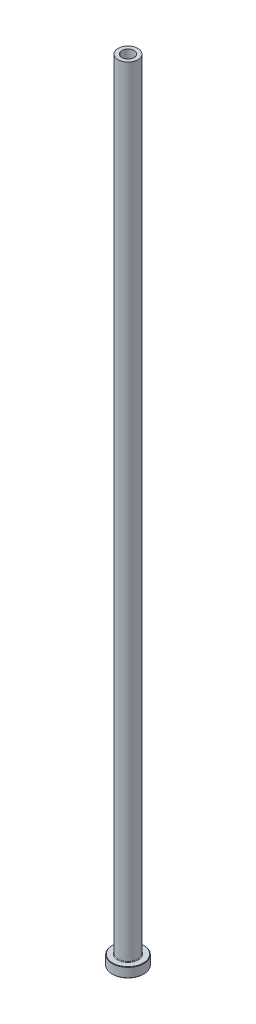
ISO-10303-21;
HEADER;
FILE_DESCRIPTION(('STEP AP214'),'2;1');
FILE_NAME('part.step','',(''),(''),'','','');
FILE_SCHEMA(('AUTOMOTIVE_DESIGN { 1 0 10303 214 1 1 1 1 }'));
ENDSEC;
DATA;
#1=APPLICATION_CONTEXT('core data for automotive mechanical design processes');
#2=APPLICATION_PROTOCOL_DEFINITION('international standard','automotive_design',2000,#1);
#3=PRODUCT_CONTEXT('',#1,'mechanical');
#4=PRODUCT('Part','Part','',(#3));
#5=PRODUCT_RELATED_PRODUCT_CATEGORY('part','',(#4));
#6=PRODUCT_DEFINITION_FORMATION('','',#4);
#7=PRODUCT_DEFINITION_CONTEXT('part definition',#1,'design');
#8=PRODUCT_DEFINITION('design','',#6,#7);
#9=PRODUCT_DEFINITION_SHAPE('','',#8);
#10=(LENGTH_UNIT() NAMED_UNIT(*) SI_UNIT(.MILLI.,.METRE.));
#11=(NAMED_UNIT(*) PLANE_ANGLE_UNIT() SI_UNIT($,.RADIAN.));
#12=(NAMED_UNIT(*) SI_UNIT($,.STERADIAN.) SOLID_ANGLE_UNIT());
#13=UNCERTAINTY_MEASURE_WITH_UNIT(LENGTH_MEASURE(1.E-05),#10,'distance_accuracy_value','');
#14=(GEOMETRIC_REPRESENTATION_CONTEXT(3) GLOBAL_UNCERTAINTY_ASSIGNED_CONTEXT((#13)) GLOBAL_UNIT_ASSIGNED_CONTEXT((#10,
#11,#12)) REPRESENTATION_CONTEXT('',''));
#15=CARTESIAN_POINT('',(0.,0.,0.));
#16=DIRECTION('',(0.,0.,1.));
#17=DIRECTION('',(1.,0.,0.));
#18=AXIS2_PLACEMENT_3D('',#15,#16,#17);
#19=CARTESIAN_POINT('',(0.,92.1876809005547,0.));
#20=DIRECTION('',(0.,1.,0.));
#21=DIRECTION('',(0.,0.,1.));
#22=AXIS2_PLACEMENT_3D('',#19,#20,#21);
#23=CYLINDRICAL_SURFACE('',#22,3.10000000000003);
#24=CARTESIAN_POINT('',(0.,400.,0.));
#25=DIRECTION('',(0.,1.,0.));
#26=DIRECTION('',(0.,0.,1.));
#27=AXIS2_PLACEMENT_3D('',#24,#25,#26);
#28=CIRCLE('',#27,3.10000000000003);
#29=CARTESIAN_POINT('',(0.,400.,3.10000000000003));
#30=VERTEX_POINT('',#29);
#31=EDGE_CURVE('E62',#30,#30,#28,.T.);
#32=ORIENTED_EDGE('',*,*,#31,.T.);
#33=EDGE_LOOP('',(#32));
#34=FACE_BOUND('',#33,.T.);
#35=CARTESIAN_POINT('',(0.,355.,0.));
#36=DIRECTION('',(0.,1.,0.));
#37=DIRECTION('',(0.,0.,1.));
#38=AXIS2_PLACEMENT_3D('',#35,#36,#37);
#39=CIRCLE('',#38,3.10000000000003);
#40=CARTESIAN_POINT('',(0.,355.,3.10000000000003));
#41=VERTEX_POINT('',#40);
#42=EDGE_CURVE('E71',#41,#41,#39,.T.);
#43=ORIENTED_EDGE('',*,*,#42,.F.);
#44=EDGE_LOOP('',(#43));
#45=FACE_BOUND('',#44,.T.);
#46=ADVANCED_FACE('F30',(#34,#45),#23,.F.);
#47=CARTESIAN_POINT('',(-3.10000000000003,400.,0.));
#48=DIRECTION('',(0.,1.,0.));
#49=DIRECTION('',(0.,0.,1.));
#50=AXIS2_PLACEMENT_3D('',#47,#48,#49);
#51=PLANE('',#50);
#52=CARTESIAN_POINT('',(0.,400.,0.));
#53=DIRECTION('',(0.,1.,0.));
#54=DIRECTION('',(0.,0.,1.));
#55=AXIS2_PLACEMENT_3D('',#52,#53,#54);
#56=CIRCLE('',#55,5.00000000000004);
#57=CARTESIAN_POINT('',(0.,400.,5.00000000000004));
#58=VERTEX_POINT('',#57);
#59=EDGE_CURVE('E65',#58,#58,#56,.T.);
#60=ORIENTED_EDGE('',*,*,#59,.T.);
#61=EDGE_LOOP('',(#60));
#62=FACE_BOUND('',#61,.T.);
#63=ORIENTED_EDGE('',*,*,#31,.F.);
#64=EDGE_LOOP('',(#63));
#65=FACE_BOUND('',#64,.T.);
#66=ADVANCED_FACE('F79',(#62,#65),#51,.T.);
#67=CARTESIAN_POINT('',(0.,92.1876809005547,0.));
#68=DIRECTION('',(0.,1.,0.));
#69=DIRECTION('',(0.,0.,1.));
#70=AXIS2_PLACEMENT_3D('',#67,#68,#69);
#71=CYLINDRICAL_SURFACE('',#70,5.00000000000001);
#72=CARTESIAN_POINT('',(0.,5.3,0.));
#73=DIRECTION('',(0.,1.,0.));
#74=DIRECTION('',(0.,0.,1.));
#75=AXIS2_PLACEMENT_3D('',#72,#73,#74);
#76=CIRCLE('',#75,5.00000000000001);
#77=CARTESIAN_POINT('',(0.,5.3,5.00000000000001));
#78=VERTEX_POINT('',#77);
#79=EDGE_CURVE('E59',#78,#78,#76,.T.);
#80=ORIENTED_EDGE('',*,*,#79,.T.);
#81=EDGE_LOOP('',(#80));
#82=FACE_BOUND('',#81,.T.);
#83=ORIENTED_EDGE('',*,*,#59,.F.);
#84=EDGE_LOOP('',(#83));
#85=FACE_BOUND('',#84,.T.);
#86=ADVANCED_FACE('F85',(#82,#85),#71,.T.);
#87=CARTESIAN_POINT('',(-4.99999999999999,5.,0.));
#88=DIRECTION('',(0.,1.,0.));
#89=DIRECTION('',(0.,0.,1.));
#90=AXIS2_PLACEMENT_3D('',#87,#88,#89);
#91=PLANE('',#90);
#92=CARTESIAN_POINT('',(0.,5.,0.));
#93=DIRECTION('',(0.,1.,0.));
#94=DIRECTION('',(0.,0.,1.));
#95=AXIS2_PLACEMENT_3D('',#92,#93,#94);
#96=CIRCLE('',#95,7.80000000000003);
#97=CARTESIAN_POINT('',(0.,5.,7.80000000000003));
#98=VERTEX_POINT('',#97);
#99=EDGE_CURVE('E53',#98,#98,#96,.T.);
#100=ORIENTED_EDGE('',*,*,#99,.T.);
#101=EDGE_LOOP('',(#100));
#102=FACE_BOUND('',#101,.T.);
#103=CARTESIAN_POINT('',(0.,5.,0.));
#104=DIRECTION('',(0.,1.,0.));
#105=DIRECTION('',(0.,0.,1.));
#106=AXIS2_PLACEMENT_3D('',#103,#104,#105);
#107=CIRCLE('',#106,5.30000000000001);
#108=CARTESIAN_POINT('',(0.,5.,5.30000000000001));
#109=VERTEX_POINT('',#108);
#110=EDGE_CURVE('E56',#109,#109,#107,.F.);
#111=ORIENTED_EDGE('',*,*,#110,.T.);
#112=EDGE_LOOP('',(#111));
#113=FACE_BOUND('',#112,.T.);
#114=ADVANCED_FACE('F111',(#102,#113),#91,.T.);
#115=CARTESIAN_POINT('',(0.,92.1876809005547,0.));
#116=DIRECTION('',(0.,1.,0.));
#117=DIRECTION('',(0.,0.,1.));
#118=AXIS2_PLACEMENT_3D('',#115,#116,#117);
#119=CYLINDRICAL_SURFACE('',#118,7.99999999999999);
#120=CARTESIAN_POINT('',(0.,4.80000000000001,0.));
#121=DIRECTION('',(0.,1.,0.));
#122=DIRECTION('',(0.,0.,1.));
#123=AXIS2_PLACEMENT_3D('',#120,#121,#122);
#124=CIRCLE('',#123,7.99999999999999);
#125=CARTESIAN_POINT('',(0.,4.80000000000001,7.99999999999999));
#126=VERTEX_POINT('',#125);
#127=EDGE_CURVE('E45',#126,#126,#124,.F.);
#128=ORIENTED_EDGE('',*,*,#127,.T.);
#129=EDGE_LOOP('',(#128));
#130=FACE_BOUND('',#129,.T.);
#131=CARTESIAN_POINT('',(0.,0.200000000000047,0.));
#132=DIRECTION('',(0.,-1.,0.));
#133=DIRECTION('',(0.,0.,-1.));
#134=AXIS2_PLACEMENT_3D('',#131,#132,#133);
#135=CIRCLE('',#134,7.99999999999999);
#136=CARTESIAN_POINT('',(0.,0.200000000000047,-7.99999999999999));
#137=VERTEX_POINT('',#136);
#138=EDGE_CURVE('E50',#137,#137,#135,.F.);
#139=ORIENTED_EDGE('',*,*,#138,.T.);
#140=EDGE_LOOP('',(#139));
#141=FACE_BOUND('',#140,.T.);
#142=ADVANCED_FACE('F108',(#130,#141),#119,.T.);
#143=CARTESIAN_POINT('',(-7.99999999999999,0.,0.));
#144=DIRECTION('',(0.,-1.,0.));
#145=DIRECTION('',(0.,0.,-1.));
#146=AXIS2_PLACEMENT_3D('',#143,#144,#145);
#147=PLANE('',#146);
#148=CARTESIAN_POINT('',(0.,0.,0.));
#149=DIRECTION('',(0.,-1.,0.));
#150=DIRECTION('',(0.,0.,-1.));
#151=AXIS2_PLACEMENT_3D('',#148,#149,#150);
#152=CIRCLE('',#151,3.84999999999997);
#153=CARTESIAN_POINT('',(0.,0.,-3.84999999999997));
#154=VERTEX_POINT('',#153);
#155=EDGE_CURVE('E37',#154,#154,#152,.F.);
#156=ORIENTED_EDGE('',*,*,#155,.T.);
#157=EDGE_LOOP('',(#156));
#158=FACE_BOUND('',#157,.T.);
#159=CARTESIAN_POINT('',(0.,0.,0.));
#160=DIRECTION('',(0.,-1.,0.));
#161=DIRECTION('',(0.,0.,-1.));
#162=AXIS2_PLACEMENT_3D('',#159,#160,#161);
#163=CIRCLE('',#162,7.79999999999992);
#164=CARTESIAN_POINT('',(0.,0.,-7.79999999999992));
#165=VERTEX_POINT('',#164);
#166=EDGE_CURVE('E41',#165,#165,#163,.T.);
#167=ORIENTED_EDGE('',*,*,#166,.T.);
#168=EDGE_LOOP('',(#167));
#169=FACE_BOUND('',#168,.T.);
#170=ADVANCED_FACE('F110',(#158,#169),#147,.T.);
#171=CARTESIAN_POINT('',(0.,92.1876809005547,0.));
#172=DIRECTION('',(0.,1.,0.));
#173=DIRECTION('',(0.,0.,1.));
#174=AXIS2_PLACEMENT_3D('',#171,#172,#173);
#175=CYLINDRICAL_SURFACE('',#174,3.35000000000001);
#176=CARTESIAN_POINT('',(0.,0.499999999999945,0.));
#177=DIRECTION('',(0.,-1.,0.));
#178=DIRECTION('',(0.,0.,-1.));
#179=AXIS2_PLACEMENT_3D('',#176,#177,#178);
#180=CIRCLE('',#179,3.35000000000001);
#181=CARTESIAN_POINT('',(0.,0.499999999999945,-3.35000000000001));
#182=VERTEX_POINT('',#181);
#183=EDGE_CURVE('E10',#182,#182,#180,.T.);
#184=ORIENTED_EDGE('',*,*,#183,.T.);
#185=EDGE_LOOP('',(#184));
#186=FACE_BOUND('',#185,.T.);
#187=CARTESIAN_POINT('',(0.,343.,0.));
#188=DIRECTION('',(0.,1.,0.));
#189=DIRECTION('',(0.,0.,1.));
#190=AXIS2_PLACEMENT_3D('',#187,#188,#189);
#191=CIRCLE('',#190,3.35000000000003);
#192=CARTESIAN_POINT('',(0.,343.,3.35000000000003));
#193=VERTEX_POINT('',#192);
#194=EDGE_CURVE('E68',#193,#193,#191,.T.);
#195=ORIENTED_EDGE('',*,*,#194,.T.);
#196=EDGE_LOOP('',(#195));
#197=FACE_BOUND('',#196,.T.);
#198=ADVANCED_FACE('F118',(#186,#197),#175,.F.);
#199=CARTESIAN_POINT('',(0.,343.,0.));
#200=DIRECTION('',(0.,-1.,0.));
#201=DIRECTION('',(0.,0.,-1.));
#202=AXIS2_PLACEMENT_3D('',#199,#200,#201);
#203=CONICAL_SURFACE('',#202,3.35000000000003,0.0208303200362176);
#204=ORIENTED_EDGE('',*,*,#42,.T.);
#205=EDGE_LOOP('',(#204));
#206=FACE_BOUND('',#205,.T.);
#207=ORIENTED_EDGE('',*,*,#194,.F.);
#208=EDGE_LOOP('',(#207));
#209=FACE_BOUND('',#208,.T.);
#210=ADVANCED_FACE('F75',(#206,#209),#203,.F.);
#211=CARTESIAN_POINT('',(0.,5.3,0.));
#212=DIRECTION('',(0.,1.,0.));
#213=DIRECTION('',(0.,0.,1.));
#214=AXIS2_PLACEMENT_3D('',#211,#212,#213);
#215=TOROIDAL_SURFACE('',#214,5.30000000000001,0.3);
#216=ORIENTED_EDGE('',*,*,#110,.F.);
#217=EDGE_LOOP('',(#216));
#218=FACE_BOUND('',#217,.T.);
#219=ORIENTED_EDGE('',*,*,#79,.F.);
#220=EDGE_LOOP('',(#219));
#221=FACE_BOUND('',#220,.T.);
#222=ADVANCED_FACE('F90',(#218,#221),#215,.F.);
#223=CARTESIAN_POINT('',(0.,5.,0.));
#224=DIRECTION('',(0.,-1.,0.));
#225=DIRECTION('',(0.,0.,-1.));
#226=AXIS2_PLACEMENT_3D('',#223,#224,#225);
#227=CONICAL_SURFACE('',#226,7.80000000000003,0.78539816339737);
#228=ORIENTED_EDGE('',*,*,#127,.F.);
#229=EDGE_LOOP('',(#228));
#230=FACE_BOUND('',#229,.T.);
#231=ORIENTED_EDGE('',*,*,#99,.F.);
#232=EDGE_LOOP('',(#231));
#233=FACE_BOUND('',#232,.T.);
#234=ADVANCED_FACE('F93',(#230,#233),#227,.T.);
#235=CARTESIAN_POINT('',(0.,0.200000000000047,0.));
#236=DIRECTION('',(0.,1.,0.));
#237=DIRECTION('',(0.,0.,1.));
#238=AXIS2_PLACEMENT_3D('',#235,#236,#237);
#239=CONICAL_SURFACE('',#238,7.99999999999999,0.785398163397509);
#240=ORIENTED_EDGE('',*,*,#166,.F.);
#241=EDGE_LOOP('',(#240));
#242=FACE_BOUND('',#241,.T.);
#243=ORIENTED_EDGE('',*,*,#138,.F.);
#244=EDGE_LOOP('',(#243));
#245=FACE_BOUND('',#244,.T.);
#246=ADVANCED_FACE('F96',(#242,#245),#239,.T.);
#247=CARTESIAN_POINT('',(0.,0.,0.));
#248=DIRECTION('',(0.,-1.,0.));
#249=DIRECTION('',(0.,0.,-1.));
#250=AXIS2_PLACEMENT_3D('',#247,#248,#249);
#251=CONICAL_SURFACE('',#250,3.84999999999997,0.785398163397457);
#252=ORIENTED_EDGE('',*,*,#183,.F.);
#253=EDGE_LOOP('',(#252));
#254=FACE_BOUND('',#253,.T.);
#255=ORIENTED_EDGE('',*,*,#155,.F.);
#256=EDGE_LOOP('',(#255));
#257=FACE_BOUND('',#256,.T.);
#258=ADVANCED_FACE('F32',(#254,#257),#251,.F.);
#259=CLOSED_SHELL('',(#46,#66,#86,#114,#142,#170,#198,#210,#222,#234,#246,#258));
#260=MANIFOLD_SOLID_BREP('B2',#259);
#261=ADVANCED_BREP_SHAPE_REPRESENTATION('',(#18,#260),#14);
#262=SHAPE_DEFINITION_REPRESENTATION(#9,#261);
ENDSEC;
END-ISO-10303-21;
